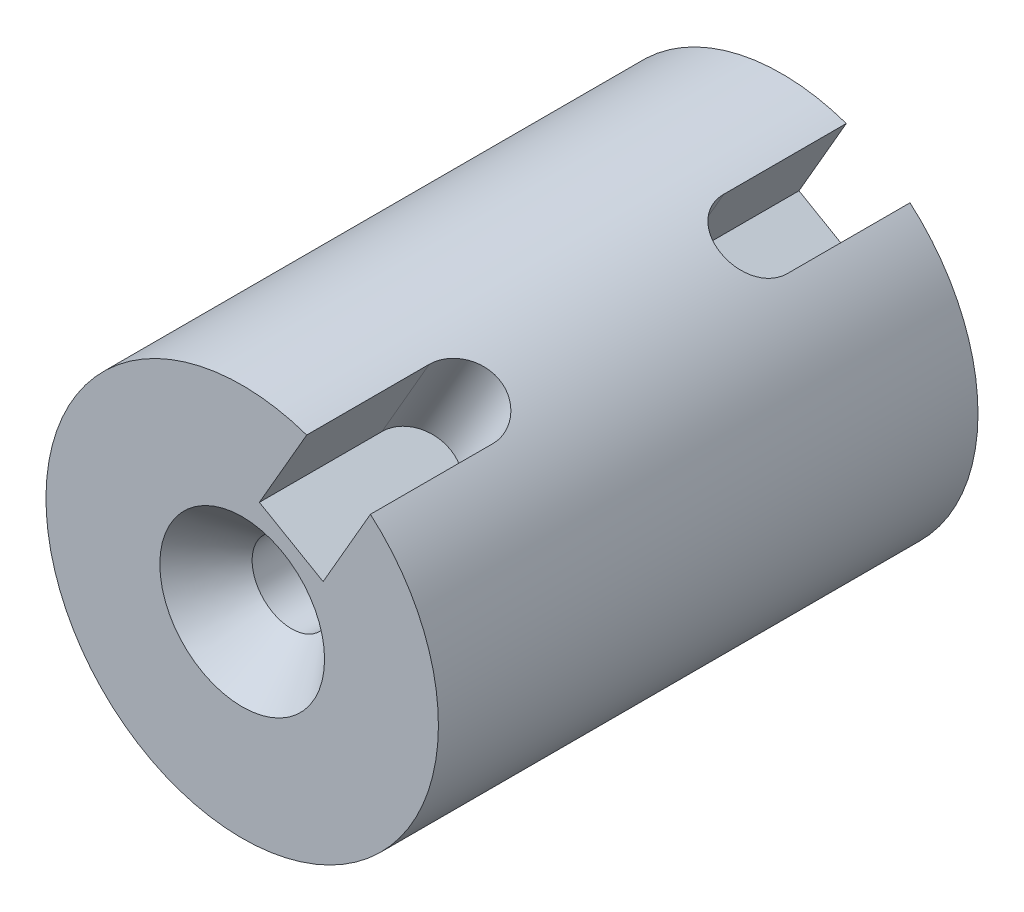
from build123d import *

# Parameters (mm, degrees)
SKETCH1_R                                       = 12.7
EXTRUDE1_DEPTH                                  = 12.7
SKETCH6_R                                       = 12.7
BOSS_EXTRUDE1_DEPTH                             = 11.1125
CSK_FOR_10_FLAT_HEAD_MACHINE_SCREW1_D           = 5.1054
CSK_FOR_10_FLAT_HEAD_MACHINE_SCREW1_CSINK_D     = 10.6621834
CSK_FOR_10_FLAT_HEAD_MACHINE_SCREW1_CSINK_ANGLE = 82
SKETCH4_R                                       = 4.7625
CUT_EXTRUDE1_DEPTH                              = 6.35
BOSS_EXTRUDE2_START                             = 11.1125
SKETCH7_R                                       = 12.7
SKETCH7_R_2                                     = 4.7625
BOSS_EXTRUDE2_DEPTH                             = 11.1125
CUT_EXTRUDE2_DEPTH                              = 6.35


with BuildPart() as part:
    # Sketch1 → Extrude1 (new body)
    with BuildSketch(Plane.XY):
        Circle(SKETCH1_R)
    extrude(amount=EXTRUDE1_DEPTH)

    # Sketch6 → Boss-Extrude1 (add)
    with BuildSketch(Plane.XY.offset(12.7)):
        Circle(SKETCH6_R)
    extrude(amount=BOSS_EXTRUDE1_DEPTH)

    # CSK for _10 Flat Head Machine Screw1 (through all)
    with Locations(Plane(origin=(-2.287131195, 3.996303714, 23.8125), x_dir=(1, 0, 0), z_dir=(0, 0, 1))):
        with Locations((2.287131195, -3.996303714)):
            CounterSinkHole(CSK_FOR_10_FLAT_HEAD_MACHINE_SCREW1_D / 2, CSK_FOR_10_FLAT_HEAD_MACHINE_SCREW1_CSINK_D / 2, counter_sink_angle=CSK_FOR_10_FLAT_HEAD_MACHINE_SCREW1_CSINK_ANGLE)

    # Sketch4 → Cut-Extrude1 (cut)
    with BuildSketch(Plane(origin=(0, 0, 0), x_dir=(-1, 0, 0), z_dir=(0, 0, -1))):
        Circle(SKETCH4_R)
    extrude(amount=-CUT_EXTRUDE1_DEPTH, mode=Mode.SUBTRACT)

    # Sketch7 → Boss-Extrude2 (add)
    with BuildSketch(Plane(origin=(0, 0, 0), x_dir=(-1, 0, 0), z_dir=(0, 0, -1)).offset(BOSS_EXTRUDE2_START)):
        Circle(SKETCH7_R)
        Circle(SKETCH7_R_2, mode=Mode.SUBTRACT)
    extrude(amount=-BOSS_EXTRUDE2_DEPTH)

    # Sketch8 → Cut-Extrude2 (cut)
    with BuildSketch(Plane(origin=(6.35, 10.998522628, 0), x_dir=(-0.8660254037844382, 0.500000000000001, 0), z_dir=(0.500000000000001, 0.8660254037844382, 0))):
        with BuildLine():
            Line((-2.38125, 15.875), (-2.38125, 23.8125))
            Line((-2.38125, 23.8125), (2.38125, 23.8125))
            Line((2.38125, 23.8125), (2.38125, 15.875))
            ThreePointArc((2.38125, 15.875), (0, 13.49375), (-2.38125, 15.875))
        make_face()
        with BuildLine():
            Line((-2.38125, -11.1125), (-2.38125, -3.175))
            ThreePointArc((-2.38125, -3.175), (0, -0.79375), (2.38125, -3.175))
            Line((2.38125, -3.175), (2.38125, -11.1125))
            Line((2.38125, -11.1125), (-2.38125, -11.1125))
        make_face()
    extrude(amount=-CUT_EXTRUDE2_DEPTH, mode=Mode.SUBTRACT)


solid = part.part
